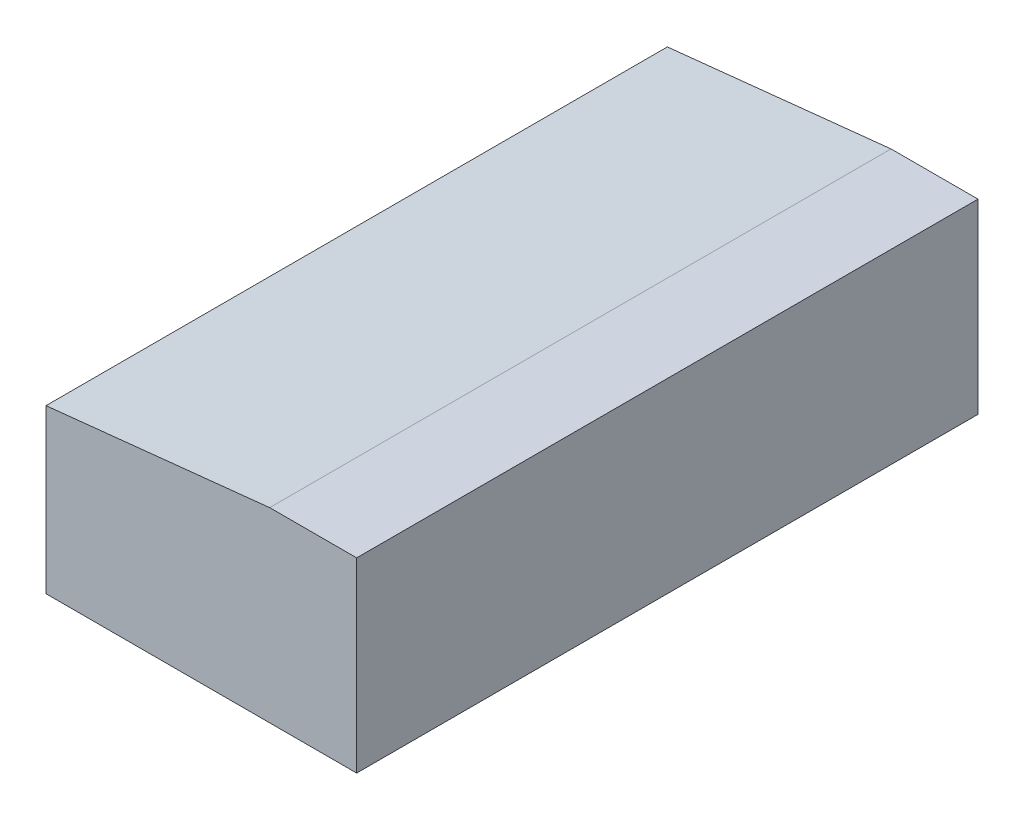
from build123d import *

# Parameters (mm, degrees)
EXTRUSION1_DEPTH = 50


with BuildPart() as part:
    # Esquisse1 → Extrusion1 (new body)
    with BuildSketch(Plane.XY):
        Polygon((0, 13.108123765), (18, 15), (25, 15), (25, 0), (0, 0), align=None)
    extrude(amount=EXTRUSION1_DEPTH)


solid = part.part
